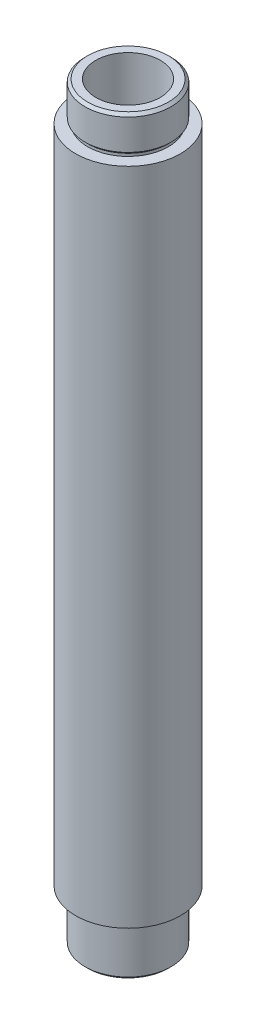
from build123d import *


with BuildPart() as part:
    # Sketch1 → Base-Revolve (revolve)
    with BuildSketch(Plane.XY, mode=Mode.PRIVATE) as base_revolve_sk:
        Polygon((11.90625, 3.33375), (15.4686, 3.33375), (15.4686, 198.25754989), (11.90625, 198.25754989), (11.90625, 199.05129989), (12.7, 199.84504989), (12.7, 208.89379989), (11.90625, 209.68754989), (9.525, 209.68754989), (9.525, 12.7), (9.525, -11.90625), (11.90625, -11.90625), (12.7, -11.1125), (12.7, 1.778), (11.90625, 2.57175), align=None)
    revolve(base_revolve_sk.sketch.rotate(Axis((0, 0, 0), (0, 1, 0)), 90), axis=Axis((0, 0, 0), (0, 1, 0)))


solid = part.part
